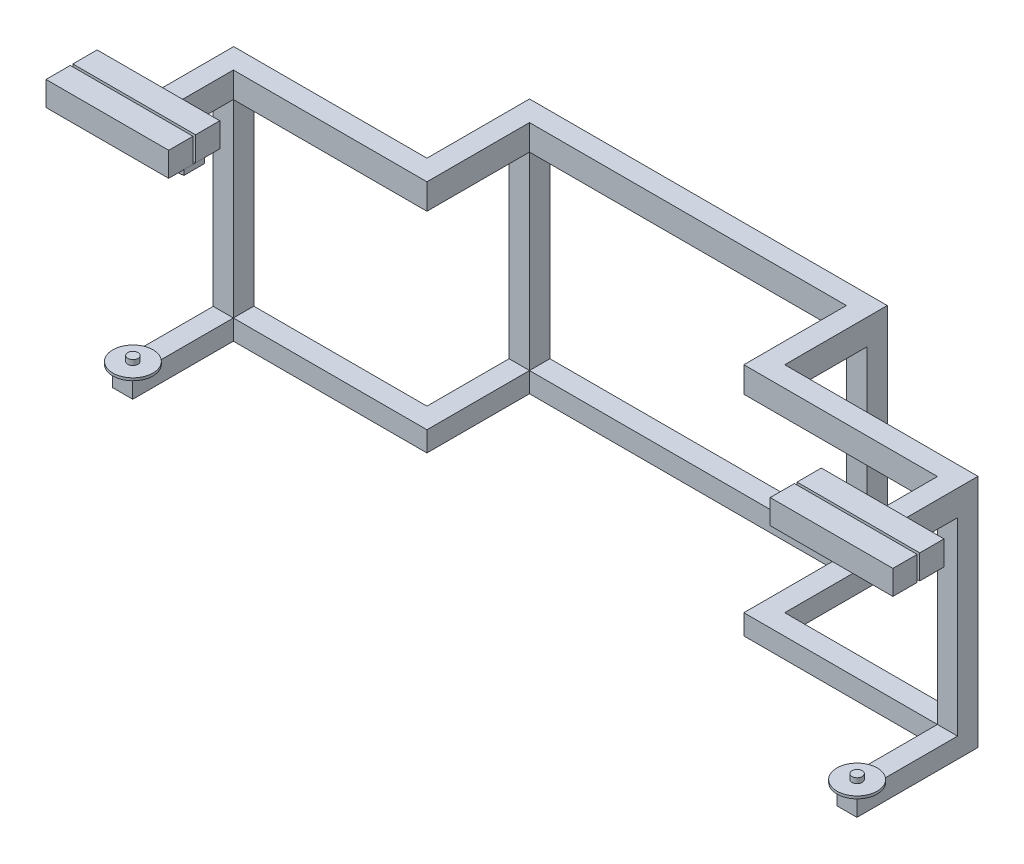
from build123d import *

# Parameters (mm, degrees)
SKETCH3_R              = 50
BOSS_EXTRUDE6_DEPTH    = 6.35
SKETCH9_W              = 50
SKETCH9_H              = 50
BOSS_EXTRUDE7_DEPTH    = 300.74578
BOSS_EXTRUDE8_DEPTH    = 50
SKETCH11_W             = 50
SKETCH11_H             = 50.8
SKETCH11_W_2           = 50.8
BOSS_EXTRUDE9_DEPTH    = 470
BOSS_EXTRUDE10_DEPTH   = 63.5
CUT_EXTRUDE1_DEPTH     = 63.5
BOSS_EXTRUDE11_DEPTH   = 6.35
SKETCH15_R             = 12.7
CUT_EXTRUDE2_DEPTH     = 12.7
SKETCH16_W             = 304.8
SKETCH16_H             = 60.325
BOSS_EXTRUDE12_DEPTH   = 60.452
BOSS_EXTRUDE12_2_DEPTH = 60.452
BOSS_EXTRUDE12_3_DEPTH = 60.452
BOSS_EXTRUDE12_4_DEPTH = 60.452
SKETCH17_R             = 12.7
BOSS_EXTRUDE13_DEPTH   = 12.7
SKETCH18_W             = 1494.35
SKETCH18_H             = 50.8
CUT_EXTRUDE3_DEPTH     = 63.5


with BuildPart() as part:
    # Sketch3 → Boss-Extrude6 (new body)
    with BuildSketch(Plane(origin=(0, 0, 0), x_dir=(1, 0, 0), z_dir=(0, 1, 0))):
        with Locations(Location((25, 25.4, 0), (0, 0, 270))):
            Circle(SKETCH3_R)
    boss_extrude6 = extrude(amount=BOSS_EXTRUDE6_DEPTH)

    # Sketch9 → Boss-Extrude7 (add)
    with BuildSketch(Plane.XY):
        with Locations((25, -25)):
            Rectangle(SKETCH9_W, SKETCH9_H)
    boss_extrude7 = extrude(amount=-BOSS_EXTRUDE7_DEPTH)

    # Sketch10 → Boss-Extrude8 (add)
    with BuildSketch(Plane(origin=(0, 0, 0), x_dir=(1, 0, 0), z_dir=(0, 1, 0))):
        Polygon((0, 300.74578), (480.153, 300.74578), (480.153, 555.53318), (530.953, 555.53318), (924.575, 555.53318), (924.575, 504.73318), (530.953, 504.73318), (530.953, 249.94578), (480.153, 249.94578), (0, 249.94578), align=None)
    boss_extrude8 = extrude(amount=-BOSS_EXTRUDE8_DEPTH)

    # Mirror1: Boss-Extrude8 across plane
    add(boss_extrude8.mirror(Plane(origin=(924.575, 0, 0), x_dir=(0, 0, 1), z_dir=(1, 0, 0))))

    # Mirror2: Boss-Extrude7 across plane
    add(boss_extrude7.mirror(Plane(origin=(924.575, 0, 0), x_dir=(0, 0, 1), z_dir=(1, 0, 0))))

    # Mirror3: Boss-Extrude6 across plane
    add(boss_extrude6.mirror(Plane(origin=(924.575, 0, 0), x_dir=(0, 0, 1), z_dir=(1, 0, 0))))

    # Sketch11 → Boss-Extrude9 (add)
    with BuildSketch(Plane(origin=(0, 0, 0), x_dir=(1, 0, 0), z_dir=(0, 1, 0))):
        with Locations((25, 275.34578)):
            Rectangle(SKETCH11_W, SKETCH11_H)
        with Locations((505.553, 530.13318)):
            Rectangle(SKETCH11_W_2, SKETCH11_H)
        with Locations((1343.597, 530.13318)):
            Rectangle(SKETCH11_W_2, SKETCH11_H)
        with Locations((1824.15, 275.34578)):
            Rectangle(SKETCH11_W, SKETCH11_H)
    extrude(amount=BOSS_EXTRUDE9_DEPTH)

    # Sketch12 → Boss-Extrude10 (add)
    with BuildSketch(Plane(origin=(0, 470.000000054, 0), x_dir=(1, 0, 0), z_dir=(0, 1, 0))):
        Polygon((0, 300.74578), (0, 0), (1849.15, 0), (1849.15, 300.74578), (1368.997, 300.74578), (1368.997, 555.53318), (480.153, 555.53318), (480.153, 300.74578), align=None)
        Polygon((1799.15, 249.94578), (1799.15, 50.8), (50, 50.8), (50, 249.94578), (530.953, 249.94578), (530.953, 504.73318), (1318.197, 504.73318), (1318.197, 249.94578), align=None, mode=Mode.SUBTRACT)
    extrude(amount=BOSS_EXTRUDE10_DEPTH)

    # Sketch13 → Cut-Extrude1 (cut)
    with BuildSketch(Plane(origin=(0, 470.000000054, 0), x_dir=(1, 0, 0), z_dir=(0, 1, 0))):
        Polygon((1849.15, 0), (1671.75, 0), (1671.75, 50.8), (1799.15, 50.8), (1799.15, 88.9), (1849.15, 88.9), (1849.15, 50.8), align=None)
        Polygon((50, 88.9), (50, 50.8), (177.4, 50.8), (177.4, 0), (0, 0), (0, 50.8), (0, 88.9), align=None)
    extrude(amount=CUT_EXTRUDE1_DEPTH, mode=Mode.SUBTRACT)


with BuildPart() as cut_extrude1_piece_1:
    # of the separate pieces the step leaves, piece 1, a body of its own (cut_extrude1_pieces)
    add(part.part.solids().sort_by_distance((25, 0, 24.6))[0])



with BuildPart() as cut_extrude1_piece_2:
    # of the separate pieces the step leaves, piece 2, a body of its own (cut_extrude1_pieces)
    add(part.part.solids().sort_by_distance((1671.75, 470.000000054, -50.8))[0])


with BuildPart() as cut_extrude1_piece_1_1:
    add(cut_extrude1_piece_1.part)

    add(cut_extrude1_piece_2.part)  # Boss-Extrude11 merges Cut-Extrude1 piece 2
    # Sketch14 → Boss-Extrude11 (add, symmetric)
    with BuildSketch(Plane(origin=(0, 501.750000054, 0), x_dir=(1, 0, 0), z_dir=(0, 1, 0))):
        with BuildLine():
            Line((50, 88.9), (0, 88.9))
            Line((0, 88.9), (-20.083837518, 47.02053641))
            ThreePointArc((-20.083837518, 47.02053641), (-14.984489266, -4.620669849), (33.183232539, -23.925801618))
            Line((33.183232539, -23.925801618), (177.4, 0))
            Line((177.4, 0), (177.4, 50.8))
            Line((177.4, 50.8), (58.838565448, 70.469539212))
            Line((58.838565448, 70.469539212), (50, 88.9))
        make_face()
        with BuildLine():
            Line((1869.233837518, 47.02053641), (1849.15, 88.9))
            Line((1849.15, 88.9), (1799.15, 88.9))
            Line((1799.15, 88.9), (1790.311434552, 70.469539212))
            Line((1790.311434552, 70.469539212), (1671.75, 50.8))
            Line((1671.75, 50.8), (1671.75, 0))
            Line((1671.75, 0), (1815.966767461, -23.925801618))
            ThreePointArc((1815.966767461, -23.925801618), (1864.134489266, -4.620669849), (1869.233837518, 47.02053641))
        make_face()
    extrude(amount=BOSS_EXTRUDE11_DEPTH, both=True)

    # Sketch15 → Cut-Extrude2 (cut)
    with BuildSketch(Plane(origin=(0, 508.100000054, 0), x_dir=(1, 0, 0), z_dir=(0, 1, 0))):
        with Locations(Location((25, 25.4, 0), (0, 0, 270))):
            Circle(SKETCH15_R)
        with Locations(Location((1824.15, 25.4, 0), (0, 0, 270))):
            Circle(SKETCH15_R)
    extrude(amount=-CUT_EXTRUDE2_DEPTH, mode=Mode.SUBTRACT)

    # Sketch17 → Boss-Extrude13 (add)
    with BuildSketch(Plane(origin=(0, 6.35, 0), x_dir=(1, 0, 0), z_dir=(0, 1, 0))):
        with Locations(Location((25, 25.4, 0), (0, 0, 270))):
            Circle(SKETCH17_R)
        with Locations(Location((1824.15, 25.4, 0), (0, 0, 270))):
            Circle(SKETCH17_R)
    extrude(amount=BOSS_EXTRUDE13_DEPTH)

    # Sketch18 → Cut-Extrude3 (cut)
    with BuildSketch(Plane(origin=(0, 533.500000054, 0), x_dir=(1, 0, 0), z_dir=(0, 1, 0))):
        with Locations((924.575, 25.4)):
            Rectangle(SKETCH18_W, SKETCH18_H)
    extrude(amount=-CUT_EXTRUDE3_DEPTH, mode=Mode.SUBTRACT)


with BuildPart() as body_2:
    # Sketch16 → Boss-Extrude12 (new body)
    with BuildSketch(Plane(origin=(0, 508.100000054, 0), x_dir=(1, 0, 0), z_dir=(0, 1, 0))):
        with Locations((25, 58.7375)):
            Rectangle(SKETCH16_W, SKETCH16_H)
    extrude(amount=BOSS_EXTRUDE12_DEPTH)


with BuildPart() as body_3:
    # Sketch16 → Boss-Extrude12 2 (new body)
    with BuildSketch(Plane(origin=(0, 508.100000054, 0), x_dir=(1, 0, 0), z_dir=(0, 1, 0))):
        with Locations((25, -7.9375)):
            Rectangle(SKETCH16_W, SKETCH16_H)
    extrude(amount=BOSS_EXTRUDE12_2_DEPTH)


with BuildPart() as body_4:
    # Sketch16 → Boss-Extrude12 3 (new body)
    with BuildSketch(Plane(origin=(0, 508.100000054, 0), x_dir=(1, 0, 0), z_dir=(0, 1, 0))):
        with Locations((1824.15, -7.9375)):
            Rectangle(SKETCH16_W, SKETCH16_H)
    extrude(amount=BOSS_EXTRUDE12_3_DEPTH)


with BuildPart() as body_5:
    # Sketch16 → Boss-Extrude12 4 (new body)
    with BuildSketch(Plane(origin=(0, 508.100000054, 0), x_dir=(1, 0, 0), z_dir=(0, 1, 0))):
        with Locations((1824.15, 58.7375)):
            Rectangle(SKETCH16_W, SKETCH16_H)
    extrude(amount=BOSS_EXTRUDE12_4_DEPTH)


solid = Compound([cut_extrude1_piece_1_1.part, body_2.part, body_3.part, body_4.part, body_5.part])
